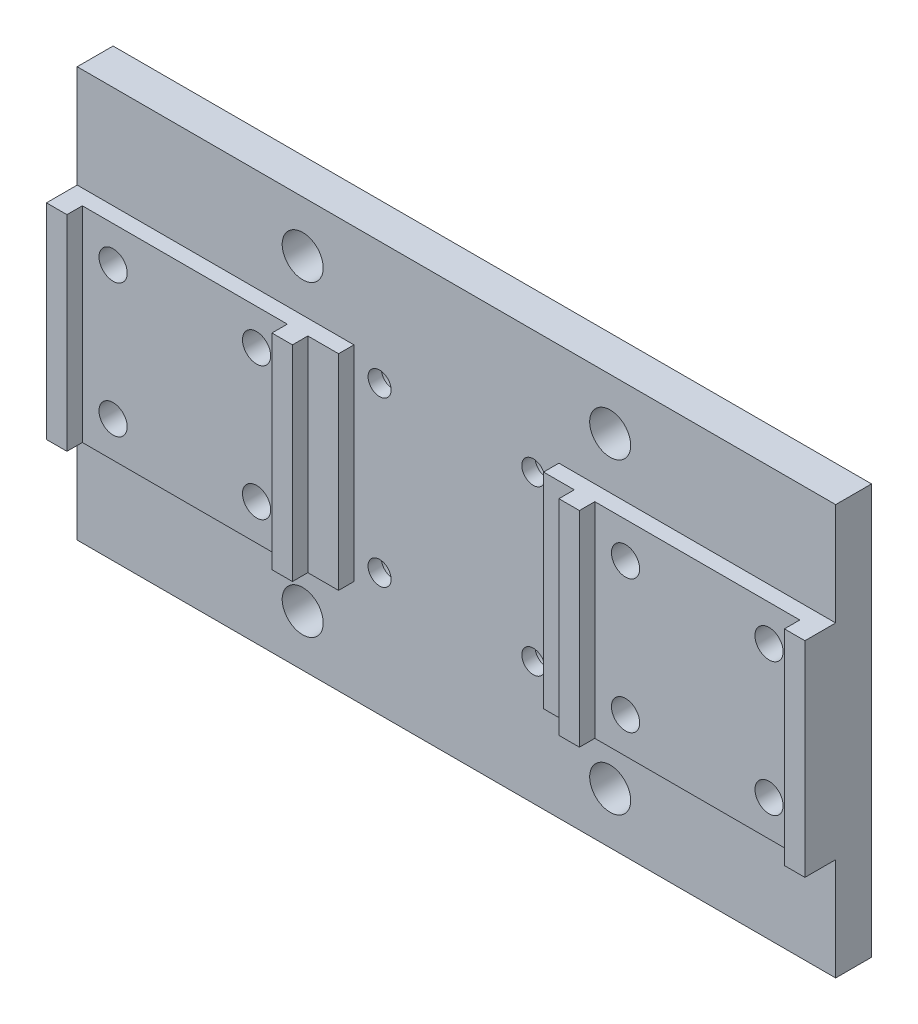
from build123d import *

# Parameters (mm, degrees)
ESQUISSE1_W                                        = 148
ESQUISSE1_H                                        = 80
ESQUISSE1_R                                        = 2.5
ESQUISSE1_R_2                                      = 2
EXTRUSION1_DEPTH                                   = 4
ESQUISSE4_W                                        = 54
ESQUISSE4_H                                        = 40
BOSS_EXTRU_1_DEPTH                                 = 3
ESQUISSE5_R                                        = 2.5
ENL_V_MAT_EXTRU_3_DEPTH                            = 92.46462522
ESQUISSE6_W                                        = 148
ESQUISSE6_H                                        = 80
BOSS_EXTRU_2_DEPTH                                 = 3
CHAMBRAGE_POUR_VIS_T_TE_HEXAGONALE_M41_D           = 4.5
CHAMBRAGE_POUR_VIS_T_TE_HEXAGONALE_M41_CBORE_D     = 8
CHAMBRAGE_POUR_VIS_T_TE_HEXAGONALE_M41_CBORE_DEPTH = 4.4
CHAMBRAGE_POUR_VIS_T_TE_HEXAGONALE_M51_D           = 5.5
CHAMBRAGE_POUR_VIS_T_TE_HEXAGONALE_M51_CBORE_D     = 10
CHAMBRAGE_POUR_VIS_T_TE_HEXAGONALE_M51_CBORE_DEPTH = 5.4
ESQUISSE11_W                                       = 4
ESQUISSE11_H                                       = 40
BOSS_EXTRU_3_DEPTH                                 = 3
ESQUISSE3_R                                        = 4
ENL_V_MAT_EXTRU_2_DEPTH                            = 92.644845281


with BuildPart() as part:
    # Esquisse1 → Extrusion1 (new body)
    with BuildSketch(Plane.XY):
        with Locations((0, -13.607626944)):
            Rectangle(ESQUISSE1_W, ESQUISSE1_H)
        with Locations((-64, -0.607626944)):
            Circle(ESQUISSE1_R, mode=Mode.SUBTRACT)
        with Locations((-36, -0.607626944)):
            Circle(ESQUISSE1_R, mode=Mode.SUBTRACT)
        with Locations((-64, -26.607626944)):
            Circle(ESQUISSE1_R, mode=Mode.SUBTRACT)
        with Locations((-36, -26.607626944)):
            Circle(ESQUISSE1_R, mode=Mode.SUBTRACT)
        with Locations((36, -0.607626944)):
            Circle(ESQUISSE1_R, mode=Mode.SUBTRACT)
        with Locations((64, -0.607626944)):
            Circle(ESQUISSE1_R, mode=Mode.SUBTRACT)
        with Locations((36, -26.607626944)):
            Circle(ESQUISSE1_R, mode=Mode.SUBTRACT)
        with Locations((64, -26.607626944)):
            Circle(ESQUISSE1_R, mode=Mode.SUBTRACT)
        with Locations((15, 2.392373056)):
            Circle(ESQUISSE1_R_2, mode=Mode.SUBTRACT)
        with Locations((15, -29.607626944)):
            Circle(ESQUISSE1_R_2, mode=Mode.SUBTRACT)
        with Locations((-15, 2.392373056)):
            Circle(ESQUISSE1_R_2, mode=Mode.SUBTRACT)
        with Locations((-15, -29.607626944)):
            Circle(ESQUISSE1_R_2, mode=Mode.SUBTRACT)
    extrude(amount=EXTRUSION1_DEPTH)

    # Esquisse4 → Boss.-Extru.1 (add)
    with BuildSketch(Plane.XY.offset(4)):
        with Locations((-47, -13.607626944)):
            Rectangle(ESQUISSE4_W, ESQUISSE4_H)
        with Locations((47, -13.607626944)):
            Rectangle(ESQUISSE4_W, ESQUISSE4_H)
    extrude(amount=BOSS_EXTRU_1_DEPTH)

    # Esquisse5 → Enl_v. mat.-Extru.3 (cut, through all)
    with BuildSketch(Plane(origin=(0, 0, 4), x_dir=(-1, 0, 0), z_dir=(0, 0, -1))):
        with Locations((-64, -0.607626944)):
            Circle(ESQUISSE5_R)
        with Locations((-36, -0.607626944)):
            Circle(ESQUISSE5_R)
        with Locations((-36, -26.607626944)):
            Circle(ESQUISSE5_R)
        with Locations((-64, -26.607626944)):
            Circle(ESQUISSE5_R)
        with Locations(Location((36, -0.607626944, 0), (0, 0, 180))):
            Circle(ESQUISSE5_R)
        with Locations(Location((64, -0.607626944, 0), (0, 0, 180))):
            Circle(ESQUISSE5_R)
        with Locations(Location((64, -26.607626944, 0), (0, 0, 180))):
            Circle(ESQUISSE5_R)
        with Locations(Location((36, -26.607626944, 0), (0, 0, 180))):
            Circle(ESQUISSE5_R)
    extrude(amount=-ENL_V_MAT_EXTRU_3_DEPTH, mode=Mode.SUBTRACT)

    # Esquisse6 → Boss.-Extru.2 (add)
    with BuildSketch(Plane(origin=(0, 0, 0), x_dir=(-1, 0, 0), z_dir=(0, 0, -1))):
        with Locations((0, -13.607626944)):
            Rectangle(ESQUISSE6_W, ESQUISSE6_H)
    extrude(amount=BOSS_EXTRU_2_DEPTH)

    # Chambrage pour vis _ t_te hexagonale M41 (through all)
    with Locations(Plane(origin=(0, 0, -3), x_dir=(-1, 0, 0), z_dir=(0, 0, -1))):
        with Locations((-15, 2.392373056), (15, 2.392373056), (15, -29.607626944), (-15, -29.607626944)):
            CounterBoreHole(CHAMBRAGE_POUR_VIS_T_TE_HEXAGONALE_M41_D / 2, CHAMBRAGE_POUR_VIS_T_TE_HEXAGONALE_M41_CBORE_D / 2, CHAMBRAGE_POUR_VIS_T_TE_HEXAGONALE_M41_CBORE_DEPTH)

    # Chambrage pour vis _ t_te hexagonale M51 (through all)
    with Locations(Plane(origin=(0, 0, -3), x_dir=(-1, 0, 0), z_dir=(0, 0, -1))):
        with Locations((-64, -0.607626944), (-36, -0.607626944), (-36, -26.607626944), (-64, -26.607626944), (36, -0.607626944), (64, -0.607626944), (64, -26.607626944), (36, -26.607626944)):
            CounterBoreHole(CHAMBRAGE_POUR_VIS_T_TE_HEXAGONALE_M51_D / 2, CHAMBRAGE_POUR_VIS_T_TE_HEXAGONALE_M51_CBORE_D / 2, CHAMBRAGE_POUR_VIS_T_TE_HEXAGONALE_M51_CBORE_DEPTH)

    # Esquisse11 → Boss.-Extru.3 (add)
    with BuildSketch(Plane.XY.offset(7)):
        with Locations((-28, -13.607626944)):
            Rectangle(ESQUISSE11_W, ESQUISSE11_H)
        with Locations((28, -13.607626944)):
            Rectangle(ESQUISSE11_W, ESQUISSE11_H)
        with Locations((-72, -13.607626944)):
            Rectangle(ESQUISSE11_W, ESQUISSE11_H)
        with Locations((72, -13.607626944)):
            Rectangle(ESQUISSE11_W, ESQUISSE11_H)
    extrude(amount=BOSS_EXTRU_3_DEPTH)

    # Esquisse3 → Enl_v. mat.-Extru.2 (cut, through all)
    with BuildSketch(Plane.XY.offset(4)):
        with Locations((-30, 16.392373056)):
            Circle(ESQUISSE3_R)
        with Locations((30, 16.392373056)):
            Circle(ESQUISSE3_R)
        with Locations((-30, -43.607626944)):
            Circle(ESQUISSE3_R)
        with Locations((30, -43.607626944)):
            Circle(ESQUISSE3_R)
    extrude(amount=-ENL_V_MAT_EXTRU_2_DEPTH, mode=Mode.SUBTRACT)


solid = part.part
